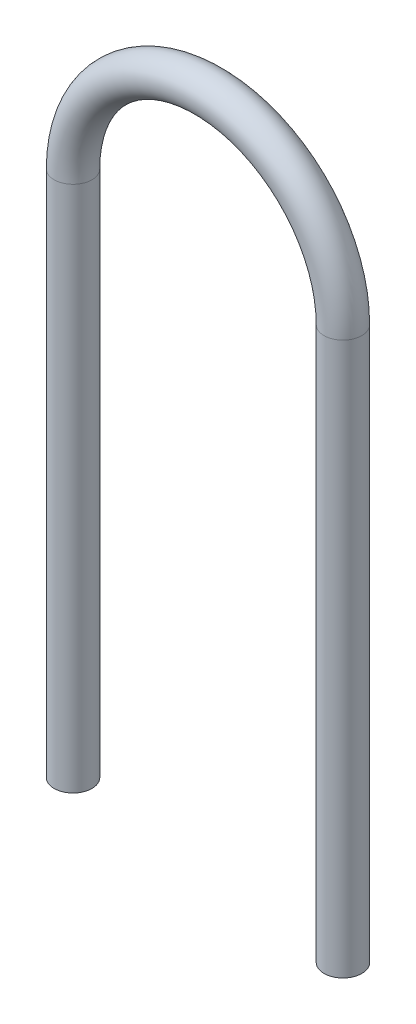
from build123d import *

# Parameters (mm, degrees)
SKETCH2_R = 7


with BuildPart() as part:
    # Sweep1: sweep along a path in Sketch1
    with BuildLine(Plane.XY) as sweep1_path:
        Line((0, 0), (0, 204.676656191))
        ThreePointArc((0, 204.676656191), (-50, 254.676656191), (-100, 204.676656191))
        Line((-100, 204.676656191), (-100, 9.353312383))
    # Sketch2 → Sweep1 (sweep)
    with BuildSketch(Plane(origin=(0, 0, 0), x_dir=(1, 0, 0), z_dir=(0, 1, 0))):
        Circle(SKETCH2_R)
    sweep(path=sweep1_path.line)


solid = part.part
